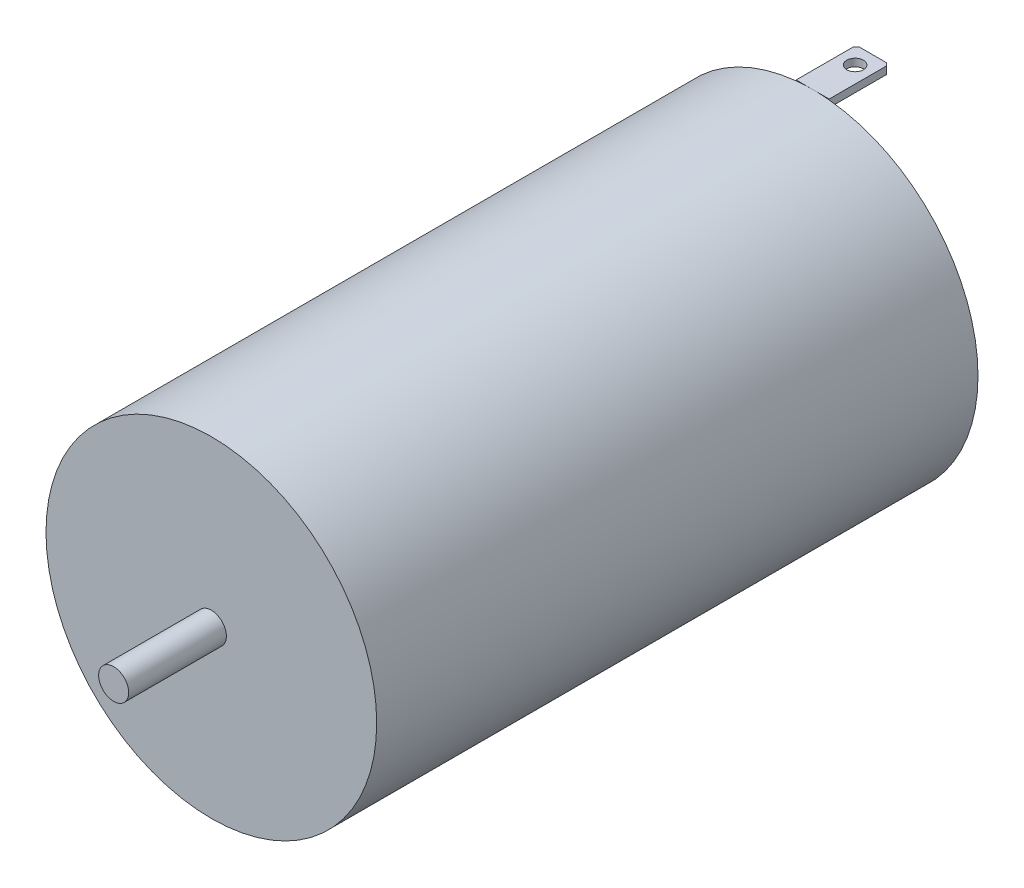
ISO-10303-21;
HEADER;
FILE_DESCRIPTION(('STEP AP214'),'2;1');
FILE_NAME('part.step','',(''),(''),'','','');
FILE_SCHEMA(('AUTOMOTIVE_DESIGN { 1 0 10303 214 1 1 1 1 }'));
ENDSEC;
DATA;
#1=APPLICATION_CONTEXT('core data for automotive mechanical design processes');
#2=APPLICATION_PROTOCOL_DEFINITION('international standard','automotive_design',2000,#1);
#3=PRODUCT_CONTEXT('',#1,'mechanical');
#4=PRODUCT('Part','Part','',(#3));
#5=PRODUCT_RELATED_PRODUCT_CATEGORY('part','',(#4));
#6=PRODUCT_DEFINITION_FORMATION('','',#4);
#7=PRODUCT_DEFINITION_CONTEXT('part definition',#1,'design');
#8=PRODUCT_DEFINITION('design','',#6,#7);
#9=PRODUCT_DEFINITION_SHAPE('','',#8);
#10=(LENGTH_UNIT() NAMED_UNIT(*) SI_UNIT(.MILLI.,.METRE.));
#11=(NAMED_UNIT(*) PLANE_ANGLE_UNIT() SI_UNIT($,.RADIAN.));
#12=(NAMED_UNIT(*) SI_UNIT($,.STERADIAN.) SOLID_ANGLE_UNIT());
#13=UNCERTAINTY_MEASURE_WITH_UNIT(LENGTH_MEASURE(1.E-05),#10,'distance_accuracy_value','');
#14=(GEOMETRIC_REPRESENTATION_CONTEXT(3) GLOBAL_UNCERTAINTY_ASSIGNED_CONTEXT((#13)) GLOBAL_UNIT_ASSIGNED_CONTEXT((#10,
#11,#12)) REPRESENTATION_CONTEXT('',''));
#15=CARTESIAN_POINT('',(0.,0.,0.));
#16=DIRECTION('',(0.,0.,1.));
#17=DIRECTION('',(1.,0.,0.));
#18=AXIS2_PLACEMENT_3D('',#15,#16,#17);
#19=CARTESIAN_POINT('',(0.,0.,0.));
#20=DIRECTION('',(0.,0.,1.));
#21=DIRECTION('',(1.,0.,0.));
#22=AXIS2_PLACEMENT_3D('',#19,#20,#21);
#23=PLANE('',#22);
#24=DIRECTION('',(0.,0.999999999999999,0.));
#25=VECTOR('',#24,1.);
#26=CARTESIAN_POINT('',(1.1,10.5,0.));
#27=LINE('',#26,#25);
#28=CARTESIAN_POINT('',(1.1,10.5,0.));
#29=VERTEX_POINT('',#28);
#30=CARTESIAN_POINT('',(1.1,10.9448618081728,0.));
#31=VERTEX_POINT('',#30);
#32=EDGE_CURVE('E190',#29,#31,#27,.T.);
#33=ORIENTED_EDGE('',*,*,#32,.T.);
#34=CARTESIAN_POINT('',(0.,0.,0.));
#35=DIRECTION('',(0.,0.,1.));
#36=DIRECTION('',(1.,0.,0.));
#37=AXIS2_PLACEMENT_3D('',#34,#35,#36);
#38=CIRCLE('',#37,11.);
#39=CARTESIAN_POINT('',(1.1,-10.9448618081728,0.));
#40=VERTEX_POINT('',#39);
#41=EDGE_CURVE('E537',#40,#31,#38,.T.);
#42=ORIENTED_EDGE('',*,*,#41,.F.);
#43=DIRECTION('',(0.,-0.999999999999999,0.));
#44=VECTOR('',#43,1.);
#45=CARTESIAN_POINT('',(1.09999999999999,-10.5,0.));
#46=LINE('',#45,#44);
#47=CARTESIAN_POINT('',(1.09999999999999,-10.5,0.));
#48=VERTEX_POINT('',#47);
#49=EDGE_CURVE('E229',#48,#40,#46,.T.);
#50=ORIENTED_EDGE('',*,*,#49,.F.);
#51=DIRECTION('',(-1.,0.,0.));
#52=VECTOR('',#51,1.);
#53=CARTESIAN_POINT('',(1.09999999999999,-10.5,0.));
#54=LINE('',#53,#52);
#55=CARTESIAN_POINT('',(-1.09999999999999,-10.5,0.));
#56=VERTEX_POINT('',#55);
#57=EDGE_CURVE('E214',#48,#56,#54,.T.);
#58=ORIENTED_EDGE('',*,*,#57,.T.);
#59=DIRECTION('',(0.,-0.999999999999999,0.));
#60=VECTOR('',#59,1.);
#61=CARTESIAN_POINT('',(-1.09999999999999,-10.5,0.));
#62=LINE('',#61,#60);
#63=CARTESIAN_POINT('',(-1.1,-10.9448618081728,0.));
#64=VERTEX_POINT('',#63);
#65=EDGE_CURVE('E224',#56,#64,#62,.T.);
#66=ORIENTED_EDGE('',*,*,#65,.T.);
#67=CARTESIAN_POINT('',(-1.10000000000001,10.9448618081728,0.));
#68=VERTEX_POINT('',#67);
#69=EDGE_CURVE('E237',#68,#64,#38,.T.);
#70=ORIENTED_EDGE('',*,*,#69,.F.);
#71=DIRECTION('',(0.,0.999999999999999,0.));
#72=VECTOR('',#71,1.);
#73=CARTESIAN_POINT('',(-1.1,10.5,0.));
#74=LINE('',#73,#72);
#75=CARTESIAN_POINT('',(-1.1,10.5,0.));
#76=VERTEX_POINT('',#75);
#77=EDGE_CURVE('E156',#76,#68,#74,.T.);
#78=ORIENTED_EDGE('',*,*,#77,.F.);
#79=DIRECTION('',(-1.,0.,0.));
#80=VECTOR('',#79,1.);
#81=CARTESIAN_POINT('',(1.1,10.5,0.));
#82=LINE('',#81,#80);
#83=EDGE_CURVE('E160',#29,#76,#82,.T.);
#84=ORIENTED_EDGE('',*,*,#83,.F.);
#85=EDGE_LOOP('',(#33,#42,#50,#58,#66,#70,#78,#84));
#86=FACE_BOUND('',#85,.T.);
#87=ADVANCED_FACE('F42',(#86),#23,.F.);
#88=CARTESIAN_POINT('',(0.,0.,40.));
#89=DIRECTION('',(0.,0.,1.));
#90=DIRECTION('',(1.,0.,0.));
#91=AXIS2_PLACEMENT_3D('',#88,#89,#90);
#92=PLANE('',#91);
#93=CARTESIAN_POINT('',(0.,0.,40.));
#94=DIRECTION('',(0.,0.,1.));
#95=DIRECTION('',(1.,0.,0.));
#96=AXIS2_PLACEMENT_3D('',#93,#94,#95);
#97=CIRCLE('',#96,11.);
#98=CARTESIAN_POINT('',(11.,0.,40.));
#99=VERTEX_POINT('',#98);
#100=EDGE_CURVE('E241',#99,#99,#97,.T.);
#101=ORIENTED_EDGE('',*,*,#100,.T.);
#102=EDGE_LOOP('',(#101));
#103=FACE_BOUND('',#102,.T.);
#104=CARTESIAN_POINT('',(0.,0.,40.));
#105=DIRECTION('',(0.,0.,1.));
#106=DIRECTION('',(1.,0.,0.));
#107=AXIS2_PLACEMENT_3D('',#104,#105,#106);
#108=CIRCLE('',#107,1.);
#109=CARTESIAN_POINT('',(1.00000000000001,0.,40.));
#110=VERTEX_POINT('',#109);
#111=EDGE_CURVE('E227',#110,#110,#108,.T.);
#112=ORIENTED_EDGE('',*,*,#111,.F.);
#113=EDGE_LOOP('',(#112));
#114=FACE_BOUND('',#113,.T.);
#115=ADVANCED_FACE('F295',(#103,#114),#92,.T.);
#116=CARTESIAN_POINT('',(0.,0.,40.));
#117=DIRECTION('',(0.,0.,-1.));
#118=DIRECTION('',(-1.,0.,0.));
#119=AXIS2_PLACEMENT_3D('',#116,#117,#118);
#120=CYLINDRICAL_SURFACE('',#119,11.);
#121=ORIENTED_EDGE('',*,*,#100,.F.);
#122=EDGE_LOOP('',(#121));
#123=FACE_BOUND('',#122,.T.);
#124=CARTESIAN_POINT('',(0.,-11.,0.));
#125=VERTEX_POINT('',#124);
#126=EDGE_CURVE('E238',#64,#125,#38,.T.);
#127=ORIENTED_EDGE('',*,*,#126,.T.);
#128=EDGE_CURVE('E242',#125,#40,#38,.T.);
#129=ORIENTED_EDGE('',*,*,#128,.T.);
#130=ORIENTED_EDGE('',*,*,#41,.T.);
#131=CARTESIAN_POINT('',(0.,11.,0.));
#132=VERTEX_POINT('',#131);
#133=EDGE_CURVE('E538',#31,#132,#38,.T.);
#134=ORIENTED_EDGE('',*,*,#133,.T.);
#135=EDGE_CURVE('E166',#132,#68,#38,.T.);
#136=ORIENTED_EDGE('',*,*,#135,.T.);
#137=ORIENTED_EDGE('',*,*,#69,.T.);
#138=EDGE_LOOP('',(#127,#129,#130,#134,#136,#137));
#139=FACE_BOUND('',#138,.T.);
#140=ADVANCED_FACE('F44',(#123,#139),#120,.T.);
#141=CARTESIAN_POINT('',(0.,0.,46.5));
#142=DIRECTION('',(0.,0.,-1.));
#143=DIRECTION('',(-1.,0.,0.));
#144=AXIS2_PLACEMENT_3D('',#141,#142,#143);
#145=CYLINDRICAL_SURFACE('',#144,1.);
#146=CARTESIAN_POINT('',(0.,0.,46.5));
#147=DIRECTION('',(0.,0.,1.));
#148=DIRECTION('',(1.,0.,0.));
#149=AXIS2_PLACEMENT_3D('',#146,#147,#148);
#150=CIRCLE('',#149,1.);
#151=CARTESIAN_POINT('',(0.999999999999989,0.,46.5));
#152=VERTEX_POINT('',#151);
#153=EDGE_CURVE('E234',#152,#152,#150,.T.);
#154=ORIENTED_EDGE('',*,*,#153,.F.);
#155=EDGE_LOOP('',(#154));
#156=FACE_BOUND('',#155,.T.);
#157=ORIENTED_EDGE('',*,*,#111,.T.);
#158=EDGE_LOOP('',(#157));
#159=FACE_BOUND('',#158,.T.);
#160=ADVANCED_FACE('F303',(#156,#159),#145,.T.);
#161=CARTESIAN_POINT('',(0.,0.,46.5));
#162=DIRECTION('',(0.,0.,1.));
#163=DIRECTION('',(1.,0.,0.));
#164=AXIS2_PLACEMENT_3D('',#161,#162,#163);
#165=PLANE('',#164);
#166=ORIENTED_EDGE('',*,*,#153,.T.);
#167=EDGE_LOOP('',(#166));
#168=FACE_BOUND('',#167,.T.);
#169=ADVANCED_FACE('F306',(#168),#165,.T.);
#170=CARTESIAN_POINT('',(1.09999999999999,-10.5,0.));
#171=DIRECTION('',(0.,0.,1.));
#172=DIRECTION('',(1.,0.,0.));
#173=AXIS2_PLACEMENT_3D('',#170,#171,#172);
#174=PLANE('',#173);
#175=ORIENTED_EDGE('',*,*,#126,.F.);
#176=CARTESIAN_POINT('',(-1.10000000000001,-11.,0.));
#177=VERTEX_POINT('',#176);
#178=EDGE_CURVE('E228',#64,#177,#62,.T.);
#179=ORIENTED_EDGE('',*,*,#178,.T.);
#180=DIRECTION('',(-1.,0.,0.));
#181=VECTOR('',#180,1.);
#182=CARTESIAN_POINT('',(1.10000000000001,-10.9999999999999,0.));
#183=LINE('',#182,#181);
#184=EDGE_CURVE('E202',#125,#177,#183,.T.);
#185=ORIENTED_EDGE('',*,*,#184,.F.);
#186=EDGE_LOOP('',(#175,#179,#185));
#187=FACE_BOUND('',#186,.T.);
#188=ADVANCED_FACE('F310',(#187),#174,.T.);
#189=ORIENTED_EDGE('',*,*,#128,.F.);
#190=CARTESIAN_POINT('',(1.10000000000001,-10.9999999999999,0.));
#191=VERTEX_POINT('',#190);
#192=EDGE_CURVE('E203',#191,#125,#183,.T.);
#193=ORIENTED_EDGE('',*,*,#192,.F.);
#194=EDGE_CURVE('E223',#40,#191,#46,.T.);
#195=ORIENTED_EDGE('',*,*,#194,.F.);
#196=EDGE_LOOP('',(#189,#193,#195));
#197=FACE_BOUND('',#196,.T.);
#198=ADVANCED_FACE('F316',(#197),#174,.T.);
#199=CARTESIAN_POINT('',(1.09999999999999,-10.5,0.));
#200=DIRECTION('',(1.,0.,0.));
#201=DIRECTION('',(0.,0.999999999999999,0.));
#202=AXIS2_PLACEMENT_3D('',#199,#200,#201);
#203=PLANE('',#202);
#204=DIRECTION('',(0.,0.,1.));
#205=VECTOR('',#204,1.);
#206=CARTESIAN_POINT('',(1.10000000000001,-10.9999999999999,0.));
#207=LINE('',#206,#205);
#208=CARTESIAN_POINT('',(1.10000000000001,-11.,-3.79999999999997));
#209=VERTEX_POINT('',#208);
#210=EDGE_CURVE('E200',#209,#191,#207,.T.);
#211=ORIENTED_EDGE('',*,*,#210,.F.);
#212=DIRECTION('',(0.,0.999999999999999,0.));
#213=VECTOR('',#212,1.);
#214=CARTESIAN_POINT('',(1.09999999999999,-10.5,-3.79999999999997));
#215=LINE('',#214,#213);
#216=CARTESIAN_POINT('',(1.09999999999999,-10.5,-3.79999999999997));
#217=VERTEX_POINT('',#216);
#218=EDGE_CURVE('E261',#209,#217,#215,.T.);
#219=ORIENTED_EDGE('',*,*,#218,.T.);
#220=DIRECTION('',(0.,0.,1.));
#221=VECTOR('',#220,1.);
#222=CARTESIAN_POINT('',(1.09999999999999,-10.5,0.));
#223=LINE('',#222,#221);
#224=EDGE_CURVE('E212',#217,#48,#223,.T.);
#225=ORIENTED_EDGE('',*,*,#224,.T.);
#226=ORIENTED_EDGE('',*,*,#49,.T.);
#227=ORIENTED_EDGE('',*,*,#194,.T.);
#228=EDGE_LOOP('',(#211,#219,#225,#226,#227));
#229=FACE_BOUND('',#228,.T.);
#230=ADVANCED_FACE('F312',(#229),#203,.T.);
#231=CARTESIAN_POINT('',(1.10000000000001,-10.5,-3.99999999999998));
#232=DIRECTION('',(0.,0.,-1.));
#233=DIRECTION('',(-1.,0.,0.));
#234=AXIS2_PLACEMENT_3D('',#231,#232,#233);
#235=PLANE('',#234);
#236=DIRECTION('',(1.,0.,0.));
#237=VECTOR('',#236,1.);
#238=CARTESIAN_POINT('',(1.09999999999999,-11.,-4.));
#239=LINE('',#238,#237);
#240=CARTESIAN_POINT('',(-0.900000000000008,-11.,-4.));
#241=VERTEX_POINT('',#240);
#242=CARTESIAN_POINT('',(0.899999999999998,-11.,-3.99999999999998));
#243=VERTEX_POINT('',#242);
#244=EDGE_CURVE('E209',#241,#243,#239,.T.);
#245=ORIENTED_EDGE('',*,*,#244,.F.);
#246=DIRECTION('',(0.,0.999999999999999,0.));
#247=VECTOR('',#246,1.);
#248=CARTESIAN_POINT('',(-0.900000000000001,-10.5,-3.99999999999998));
#249=LINE('',#248,#247);
#250=CARTESIAN_POINT('',(-0.900000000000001,-10.5,-3.99999999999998));
#251=VERTEX_POINT('',#250);
#252=EDGE_CURVE('E255',#241,#251,#249,.T.);
#253=ORIENTED_EDGE('',*,*,#252,.T.);
#254=DIRECTION('',(1.,0.,0.));
#255=VECTOR('',#254,1.);
#256=CARTESIAN_POINT('',(1.10000000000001,-10.5,-3.99999999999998));
#257=LINE('',#256,#255);
#258=CARTESIAN_POINT('',(0.899999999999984,-10.5,-3.99999999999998));
#259=VERTEX_POINT('',#258);
#260=EDGE_CURVE('E220',#251,#259,#257,.T.);
#261=ORIENTED_EDGE('',*,*,#260,.T.);
#262=DIRECTION('',(0.,-0.999999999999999,0.));
#263=VECTOR('',#262,1.);
#264=CARTESIAN_POINT('',(0.899999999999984,-10.5,-3.99999999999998));
#265=LINE('',#264,#263);
#266=EDGE_CURVE('E252',#259,#243,#265,.T.);
#267=ORIENTED_EDGE('',*,*,#266,.T.);
#268=EDGE_LOOP('',(#245,#253,#261,#267));
#269=FACE_BOUND('',#268,.T.);
#270=ADVANCED_FACE('F315',(#269),#235,.T.);
#271=CARTESIAN_POINT('',(-1.09999999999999,-10.5,0.));
#272=DIRECTION('',(-1.,0.,0.));
#273=DIRECTION('',(0.,-0.999999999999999,0.));
#274=AXIS2_PLACEMENT_3D('',#271,#272,#273);
#275=PLANE('',#274);
#276=DIRECTION('',(0.,0.,-1.));
#277=VECTOR('',#276,1.);
#278=CARTESIAN_POINT('',(-1.09999999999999,-10.5,0.));
#279=LINE('',#278,#277);
#280=CARTESIAN_POINT('',(-1.09999999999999,-10.5,-3.79999999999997));
#281=VERTEX_POINT('',#280);
#282=EDGE_CURVE('E217',#56,#281,#279,.T.);
#283=ORIENTED_EDGE('',*,*,#282,.T.);
#284=DIRECTION('',(0.,-0.999999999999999,0.));
#285=VECTOR('',#284,1.);
#286=CARTESIAN_POINT('',(-1.09999999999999,-10.5,-3.79999999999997));
#287=LINE('',#286,#285);
#288=CARTESIAN_POINT('',(-1.1,-11.,-3.79999999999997));
#289=VERTEX_POINT('',#288);
#290=EDGE_CURVE('E245',#281,#289,#287,.T.);
#291=ORIENTED_EDGE('',*,*,#290,.T.);
#292=DIRECTION('',(0.,0.,-1.));
#293=VECTOR('',#292,1.);
#294=CARTESIAN_POINT('',(-1.10000000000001,-11.,0.));
#295=LINE('',#294,#293);
#296=EDGE_CURVE('E206',#177,#289,#295,.T.);
#297=ORIENTED_EDGE('',*,*,#296,.F.);
#298=ORIENTED_EDGE('',*,*,#178,.F.);
#299=ORIENTED_EDGE('',*,*,#65,.F.);
#300=EDGE_LOOP('',(#283,#291,#297,#298,#299));
#301=FACE_BOUND('',#300,.T.);
#302=ADVANCED_FACE('F321',(#301),#275,.T.);
#303=CARTESIAN_POINT('',(1.10000000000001,-10.5,-3.99999999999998));
#304=DIRECTION('',(0.,0.999999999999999,0.));
#305=DIRECTION('',(0.,0.,1.));
#306=AXIS2_PLACEMENT_3D('',#303,#304,#305);
#307=PLANE('',#306);
#308=CARTESIAN_POINT('',(0.,-10.5,-2.8244894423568));
#309=DIRECTION('',(0.,-0.999999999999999,0.));
#310=DIRECTION('',(1.,0.,0.));
#311=AXIS2_PLACEMENT_3D('',#308,#309,#310);
#312=CIRCLE('',#311,0.554374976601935);
#313=CARTESIAN_POINT('',(0.554374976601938,-10.5,-2.8244894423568));
#314=VERTEX_POINT('',#313);
#315=EDGE_CURVE('E197',#314,#314,#312,.T.);
#316=ORIENTED_EDGE('',*,*,#315,.T.);
#317=EDGE_LOOP('',(#316));
#318=FACE_BOUND('',#317,.T.);
#319=ORIENTED_EDGE('',*,*,#260,.F.);
#320=DIRECTION('',(0.70710678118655,0.,-0.707106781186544));
#321=VECTOR('',#320,1.);
#322=CARTESIAN_POINT('',(0.100000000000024,-10.5,-4.99999999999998));
#323=LINE('',#322,#321);
#324=EDGE_CURVE('E259',#251,#281,#323,.F.);
#325=ORIENTED_EDGE('',*,*,#324,.T.);
#326=ORIENTED_EDGE('',*,*,#282,.F.);
#327=ORIENTED_EDGE('',*,*,#57,.F.);
#328=ORIENTED_EDGE('',*,*,#224,.F.);
#329=DIRECTION('',(0.707106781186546,0.,0.707106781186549));
#330=VECTOR('',#329,1.);
#331=CARTESIAN_POINT('',(0.999999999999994,-10.5,-3.90000000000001));
#332=LINE('',#331,#330);
#333=EDGE_CURVE('E257',#217,#259,#332,.F.);
#334=ORIENTED_EDGE('',*,*,#333,.T.);
#335=EDGE_LOOP('',(#319,#325,#326,#327,#328,#334));
#336=FACE_BOUND('',#335,.T.);
#337=ADVANCED_FACE('F324',(#318,#336),#307,.T.);
#338=CARTESIAN_POINT('',(1.09999999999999,-11.,-4.));
#339=DIRECTION('',(0.,0.999999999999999,0.));
#340=DIRECTION('',(0.,0.,1.));
#341=AXIS2_PLACEMENT_3D('',#338,#339,#340);
#342=PLANE('',#341);
#343=CARTESIAN_POINT('',(0.,-11.,-2.8244894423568));
#344=DIRECTION('',(0.,-0.999999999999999,0.));
#345=DIRECTION('',(1.,0.,0.));
#346=AXIS2_PLACEMENT_3D('',#343,#344,#345);
#347=CIRCLE('',#346,0.554374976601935);
#348=CARTESIAN_POINT('',(0.554374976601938,-11.,-2.8244894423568));
#349=VERTEX_POINT('',#348);
#350=EDGE_CURVE('E192',#349,#349,#347,.T.);
#351=ORIENTED_EDGE('',*,*,#350,.F.);
#352=EDGE_LOOP('',(#351));
#353=FACE_BOUND('',#352,.T.);
#354=ORIENTED_EDGE('',*,*,#296,.T.);
#355=DIRECTION('',(-0.70710678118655,0.,0.707106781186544));
#356=VECTOR('',#355,1.);
#357=CARTESIAN_POINT('',(-1.1,-11.,-3.79999999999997));
#358=LINE('',#357,#356);
#359=EDGE_CURVE('E250',#289,#241,#358,.F.);
#360=ORIENTED_EDGE('',*,*,#359,.T.);
#361=ORIENTED_EDGE('',*,*,#244,.T.);
#362=DIRECTION('',(-0.707106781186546,0.,-0.707106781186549));
#363=VECTOR('',#362,1.);
#364=CARTESIAN_POINT('',(0.899999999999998,-11.,-3.99999999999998));
#365=LINE('',#364,#363);
#366=EDGE_CURVE('E248',#243,#209,#365,.F.);
#367=ORIENTED_EDGE('',*,*,#366,.T.);
#368=ORIENTED_EDGE('',*,*,#210,.T.);
#369=ORIENTED_EDGE('',*,*,#192,.T.);
#370=ORIENTED_EDGE('',*,*,#184,.T.);
#371=EDGE_LOOP('',(#354,#360,#361,#367,#368,#369,#370));
#372=FACE_BOUND('',#371,.T.);
#373=ADVANCED_FACE('F331',(#353,#372),#342,.F.);
#374=CARTESIAN_POINT('',(0.,-10.5,-2.8244894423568));
#375=DIRECTION('',(0.,-0.999999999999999,0.));
#376=DIRECTION('',(1.,0.,0.));
#377=AXIS2_PLACEMENT_3D('',#374,#375,#376);
#378=CYLINDRICAL_SURFACE('',#377,0.554374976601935);
#379=CARTESIAN_POINT('',(0.554374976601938,-10.5,-2.8244894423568));
#380=CARTESIAN_POINT('',(0.554374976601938,-10.5052083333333,-2.8244894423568));
#381=CARTESIAN_POINT('',(0.554374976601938,-10.5104166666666,-2.8244894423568));
#382=CARTESIAN_POINT('',(0.554374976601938,-10.5208333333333,-2.8244894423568));
#383=CARTESIAN_POINT('',(0.554374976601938,-10.5260416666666,-2.8244894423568));
#384=CARTESIAN_POINT('',(0.554374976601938,-10.5364583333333,-2.8244894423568));
#385=CARTESIAN_POINT('',(0.554374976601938,-10.5416666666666,-2.8244894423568));
#386=CARTESIAN_POINT('',(0.554374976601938,-10.5520833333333,-2.8244894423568));
#387=CARTESIAN_POINT('',(0.554374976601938,-10.5572916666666,-2.8244894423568));
#388=CARTESIAN_POINT('',(0.554374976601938,-10.5677083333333,-2.8244894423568));
#389=CARTESIAN_POINT('',(0.554374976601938,-10.5729166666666,-2.8244894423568));
#390=CARTESIAN_POINT('',(0.554374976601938,-10.5833333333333,-2.8244894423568));
#391=CARTESIAN_POINT('',(0.554374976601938,-10.5885416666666,-2.8244894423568));
#392=CARTESIAN_POINT('',(0.554374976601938,-10.5989583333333,-2.8244894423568));
#393=CARTESIAN_POINT('',(0.554374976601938,-10.6041666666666,-2.8244894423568));
#394=CARTESIAN_POINT('',(0.554374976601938,-10.6145833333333,-2.8244894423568));
#395=CARTESIAN_POINT('',(0.554374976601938,-10.6197916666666,-2.8244894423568));
#396=CARTESIAN_POINT('',(0.554374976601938,-10.6302083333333,-2.8244894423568));
#397=CARTESIAN_POINT('',(0.554374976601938,-10.6354166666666,-2.8244894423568));
#398=CARTESIAN_POINT('',(0.554374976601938,-10.6458333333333,-2.8244894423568));
#399=CARTESIAN_POINT('',(0.554374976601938,-10.6510416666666,-2.8244894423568));
#400=CARTESIAN_POINT('',(0.554374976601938,-10.6614583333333,-2.8244894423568));
#401=CARTESIAN_POINT('',(0.554374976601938,-10.6666666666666,-2.8244894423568));
#402=CARTESIAN_POINT('',(0.554374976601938,-10.6770833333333,-2.8244894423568));
#403=CARTESIAN_POINT('',(0.554374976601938,-10.6822916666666,-2.8244894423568));
#404=CARTESIAN_POINT('',(0.554374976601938,-10.6927083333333,-2.8244894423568));
#405=CARTESIAN_POINT('',(0.554374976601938,-10.6979166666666,-2.8244894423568));
#406=CARTESIAN_POINT('',(0.554374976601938,-10.7083333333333,-2.8244894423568));
#407=CARTESIAN_POINT('',(0.554374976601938,-10.7135416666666,-2.8244894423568));
#408=CARTESIAN_POINT('',(0.554374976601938,-10.7239583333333,-2.8244894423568));
#409=CARTESIAN_POINT('',(0.554374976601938,-10.7291666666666,-2.8244894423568));
#410=CARTESIAN_POINT('',(0.554374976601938,-10.7395833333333,-2.8244894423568));
#411=CARTESIAN_POINT('',(0.554374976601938,-10.7447916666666,-2.8244894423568));
#412=CARTESIAN_POINT('',(0.554374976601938,-10.7552083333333,-2.8244894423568));
#413=CARTESIAN_POINT('',(0.554374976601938,-10.7604166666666,-2.8244894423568));
#414=CARTESIAN_POINT('',(0.554374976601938,-10.7708333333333,-2.8244894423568));
#415=CARTESIAN_POINT('',(0.554374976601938,-10.7760416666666,-2.8244894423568));
#416=CARTESIAN_POINT('',(0.554374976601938,-10.7864583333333,-2.8244894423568));
#417=CARTESIAN_POINT('',(0.554374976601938,-10.7916666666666,-2.8244894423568));
#418=CARTESIAN_POINT('',(0.554374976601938,-10.8020833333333,-2.8244894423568));
#419=CARTESIAN_POINT('',(0.554374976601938,-10.8072916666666,-2.8244894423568));
#420=CARTESIAN_POINT('',(0.554374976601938,-10.8177083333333,-2.8244894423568));
#421=CARTESIAN_POINT('',(0.554374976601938,-10.8229166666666,-2.8244894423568));
#422=CARTESIAN_POINT('',(0.554374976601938,-10.8333333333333,-2.8244894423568));
#423=CARTESIAN_POINT('',(0.554374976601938,-10.8385416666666,-2.8244894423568));
#424=CARTESIAN_POINT('',(0.554374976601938,-10.8489583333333,-2.8244894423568));
#425=CARTESIAN_POINT('',(0.554374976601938,-10.8541666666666,-2.8244894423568));
#426=CARTESIAN_POINT('',(0.554374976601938,-10.8645833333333,-2.8244894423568));
#427=CARTESIAN_POINT('',(0.554374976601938,-10.8697916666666,-2.8244894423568));
#428=CARTESIAN_POINT('',(0.554374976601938,-10.8802083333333,-2.8244894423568));
#429=CARTESIAN_POINT('',(0.554374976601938,-10.8854166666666,-2.8244894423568));
#430=CARTESIAN_POINT('',(0.554374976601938,-10.8958333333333,-2.8244894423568));
#431=CARTESIAN_POINT('',(0.554374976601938,-10.9010416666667,-2.8244894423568));
#432=CARTESIAN_POINT('',(0.554374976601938,-10.9114583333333,-2.8244894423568));
#433=CARTESIAN_POINT('',(0.554374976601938,-10.9166666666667,-2.8244894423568));
#434=CARTESIAN_POINT('',(0.554374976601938,-10.9270833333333,-2.8244894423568));
#435=CARTESIAN_POINT('',(0.554374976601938,-10.9322916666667,-2.8244894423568));
#436=CARTESIAN_POINT('',(0.554374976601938,-10.9427083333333,-2.8244894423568));
#437=CARTESIAN_POINT('',(0.554374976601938,-10.9479166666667,-2.8244894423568));
#438=CARTESIAN_POINT('',(0.554374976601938,-10.9583333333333,-2.8244894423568));
#439=CARTESIAN_POINT('',(0.554374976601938,-10.9635416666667,-2.8244894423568));
#440=CARTESIAN_POINT('',(0.554374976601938,-10.9739583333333,-2.8244894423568));
#441=CARTESIAN_POINT('',(0.554374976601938,-10.9791666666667,-2.8244894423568));
#442=CARTESIAN_POINT('',(0.554374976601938,-10.9895833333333,-2.8244894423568));
#443=CARTESIAN_POINT('',(0.554374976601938,-10.9947916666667,-2.8244894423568));
#444=CARTESIAN_POINT('',(0.554374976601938,-11.,-2.8244894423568));
#445=B_SPLINE_CURVE_WITH_KNOTS('',3,(#379,#380,#381,#382,#383,#384,#385,#386,#387,#388,#389,
#390,#391,#392,#393,#394,#395,#396,#397,#398,#399,#400,#401,#402,#403,#404,#405,#406,#407,#408,
#409,#410,#411,#412,#413,#414,#415,#416,#417,#418,#419,#420,#421,#422,#423,#424,#425,#426,#427,
#428,#429,#430,#431,#432,#433,#434,#435,#436,#437,#438,#439,#440,#441,#442,#443,#444),
.UNSPECIFIED.,.F.,.F.,(4,2,2,2,2,2,2,2,2,2,2,2,2,2,2,2,2,2,2,2,2,2,2,2,2,2,2,2,2,2,2,2,4),(0.,
0.0156250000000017,0.0312500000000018,0.0468750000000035,0.0625000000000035,0.0781250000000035,
0.0937500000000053,0.109375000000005,0.125000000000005,0.140625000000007,0.156250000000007,
0.171875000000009,0.187500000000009,0.203125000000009,0.218750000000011,0.234375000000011,
0.250000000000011,0.265625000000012,0.281250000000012,0.296875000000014,0.312500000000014,
0.328125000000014,0.343750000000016,0.359375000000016,0.375000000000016,0.390625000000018,
0.406250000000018,0.421875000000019,0.437500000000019,0.453125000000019,0.468750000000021,
0.484375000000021,0.500000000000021),.UNSPECIFIED.);
#446=EDGE_CURVE('BSEAM335',#314,#349,#445,.T.);
#447=ORIENTED_EDGE('',*,*,#315,.F.);
#448=ORIENTED_EDGE('',*,*,#350,.T.);
#449=ORIENTED_EDGE('',*,*,#446,.T.);
#450=ORIENTED_EDGE('',*,*,#446,.F.);
#451=EDGE_LOOP('',(#447,#449,#448,#450));
#452=FACE_BOUND('',#451,.T.);
#453=ADVANCED_FACE('F335',(#452),#378,.F.);
#454=CARTESIAN_POINT('',(-1.09999999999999,-10.5,-3.79999999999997));
#455=DIRECTION('',(0.707106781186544,0.,0.707106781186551));
#456=DIRECTION('',(0.70710678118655,0.,-0.707106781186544));
#457=AXIS2_PLACEMENT_3D('',#454,#455,#456);
#458=PLANE('',#457);
#459=ORIENTED_EDGE('',*,*,#324,.F.);
#460=ORIENTED_EDGE('',*,*,#252,.F.);
#461=ORIENTED_EDGE('',*,*,#359,.F.);
#462=ORIENTED_EDGE('',*,*,#290,.F.);
#463=EDGE_LOOP('',(#459,#460,#461,#462));
#464=FACE_BOUND('',#463,.T.);
#465=ADVANCED_FACE('F339',(#464),#458,.F.);
#466=CARTESIAN_POINT('',(0.899999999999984,-10.5,-3.99999999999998));
#467=DIRECTION('',(-0.707106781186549,0.,0.707106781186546));
#468=DIRECTION('',(0.707106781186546,0.,0.707106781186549));
#469=AXIS2_PLACEMENT_3D('',#466,#467,#468);
#470=PLANE('',#469);
#471=ORIENTED_EDGE('',*,*,#333,.F.);
#472=ORIENTED_EDGE('',*,*,#218,.F.);
#473=ORIENTED_EDGE('',*,*,#366,.F.);
#474=ORIENTED_EDGE('',*,*,#266,.F.);
#475=EDGE_LOOP('',(#471,#472,#473,#474));
#476=FACE_BOUND('',#475,.T.);
#477=ADVANCED_FACE('F343',(#476),#470,.F.);
#478=CARTESIAN_POINT('',(1.1,10.5,0.));
#479=DIRECTION('',(0.,0.,-1.));
#480=DIRECTION('',(-1.,0.,0.));
#481=AXIS2_PLACEMENT_3D('',#478,#479,#480);
#482=PLANE('',#481);
#483=CARTESIAN_POINT('',(-1.1,11.,0.));
#484=VERTEX_POINT('',#483);
#485=EDGE_CURVE('E150',#68,#484,#74,.T.);
#486=ORIENTED_EDGE('',*,*,#485,.F.);
#487=ORIENTED_EDGE('',*,*,#135,.F.);
#488=DIRECTION('',(-1.,0.,0.));
#489=VECTOR('',#488,1.);
#490=CARTESIAN_POINT('',(1.09999999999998,11.,0.));
#491=LINE('',#490,#489);
#492=EDGE_CURVE('E163',#132,#484,#491,.T.);
#493=ORIENTED_EDGE('',*,*,#492,.T.);
#494=EDGE_LOOP('',(#486,#487,#493));
#495=FACE_BOUND('',#494,.T.);
#496=ADVANCED_FACE('F164',(#495),#482,.F.);
#497=CARTESIAN_POINT('',(1.09999999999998,11.,0.));
#498=VERTEX_POINT('',#497);
#499=EDGE_CURVE('E170',#498,#132,#491,.T.);
#500=ORIENTED_EDGE('',*,*,#499,.T.);
#501=ORIENTED_EDGE('',*,*,#133,.F.);
#502=EDGE_CURVE('E193',#31,#498,#27,.T.);
#503=ORIENTED_EDGE('',*,*,#502,.T.);
#504=EDGE_LOOP('',(#500,#501,#503));
#505=FACE_BOUND('',#504,.T.);
#506=ADVANCED_FACE('F358',(#505),#482,.F.);
#507=CARTESIAN_POINT('',(1.1,10.5,-3.99999999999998));
#508=DIRECTION('',(0.,-0.999999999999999,0.));
#509=DIRECTION('',(0.,0.,1.));
#510=AXIS2_PLACEMENT_3D('',#507,#508,#509);
#511=PLANE('',#510);
#512=DIRECTION('',(0.,0.,-1.));
#513=VECTOR('',#512,1.);
#514=CARTESIAN_POINT('',(-1.1,10.5,0.));
#515=LINE('',#514,#513);
#516=CARTESIAN_POINT('',(-1.10000000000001,10.5,-3.8));
#517=VERTEX_POINT('',#516);
#518=EDGE_CURVE('E187',#76,#517,#515,.T.);
#519=ORIENTED_EDGE('',*,*,#518,.T.);
#520=DIRECTION('',(-0.70710678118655,0.,0.707106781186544));
#521=VECTOR('',#520,1.);
#522=CARTESIAN_POINT('',(0.100000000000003,10.5,-5.));
#523=LINE('',#522,#521);
#524=CARTESIAN_POINT('',(-0.900000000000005,10.5,-3.99999999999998));
#525=VERTEX_POINT('',#524);
#526=EDGE_CURVE('E50',#517,#525,#523,.F.);
#527=ORIENTED_EDGE('',*,*,#526,.T.);
#528=DIRECTION('',(1.,0.,0.));
#529=VECTOR('',#528,1.);
#530=CARTESIAN_POINT('',(1.1,10.5,-3.99999999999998));
#531=LINE('',#530,#529);
#532=CARTESIAN_POINT('',(0.900000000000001,10.5,-4.));
#533=VERTEX_POINT('',#532);
#534=EDGE_CURVE('E185',#525,#533,#531,.T.);
#535=ORIENTED_EDGE('',*,*,#534,.T.);
#536=DIRECTION('',(-0.707106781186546,0.,-0.707106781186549));
#537=VECTOR('',#536,1.);
#538=CARTESIAN_POINT('',(1.00000000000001,10.5,-3.89999999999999));
#539=LINE('',#538,#537);
#540=CARTESIAN_POINT('',(1.09999999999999,10.5,-3.8));
#541=VERTEX_POINT('',#540);
#542=EDGE_CURVE('E57',#533,#541,#539,.F.);
#543=ORIENTED_EDGE('',*,*,#542,.T.);
#544=DIRECTION('',(0.,0.,1.));
#545=VECTOR('',#544,1.);
#546=CARTESIAN_POINT('',(1.1,10.5,0.));
#547=LINE('',#546,#545);
#548=EDGE_CURVE('E183',#541,#29,#547,.T.);
#549=ORIENTED_EDGE('',*,*,#548,.T.);
#550=ORIENTED_EDGE('',*,*,#83,.T.);
#551=EDGE_LOOP('',(#519,#527,#535,#543,#549,#550));
#552=FACE_BOUND('',#551,.T.);
#553=CARTESIAN_POINT('',(0.,10.5,-2.8244894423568));
#554=DIRECTION('',(0.,-0.999999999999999,0.));
#555=DIRECTION('',(1.,0.,0.));
#556=AXIS2_PLACEMENT_3D('',#553,#554,#555);
#557=CIRCLE('',#556,0.554374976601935);
#558=CARTESIAN_POINT('',(-0.554374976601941,10.5,-2.8244894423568));
#559=VERTEX_POINT('',#558);
#560=EDGE_CURVE('E546',#559,#559,#557,.T.);
#561=ORIENTED_EDGE('',*,*,#560,.F.);
#562=EDGE_LOOP('',(#561));
#563=FACE_BOUND('',#562,.T.);
#564=ADVANCED_FACE('F274',(#552,#563),#511,.T.);
#565=CARTESIAN_POINT('',(1.1,11.,-3.99999999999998));
#566=DIRECTION('',(0.,-0.999999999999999,0.));
#567=DIRECTION('',(0.,0.,1.));
#568=AXIS2_PLACEMENT_3D('',#565,#566,#567);
#569=PLANE('',#568);
#570=DIRECTION('',(1.,0.,0.));
#571=VECTOR('',#570,1.);
#572=CARTESIAN_POINT('',(1.1,11.,-3.99999999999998));
#573=LINE('',#572,#571);
#574=CARTESIAN_POINT('',(-0.900000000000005,11.,-4.));
#575=VERTEX_POINT('',#574);
#576=CARTESIAN_POINT('',(0.899999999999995,11.,-3.99999999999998));
#577=VERTEX_POINT('',#576);
#578=EDGE_CURVE('E176',#575,#577,#573,.T.);
#579=ORIENTED_EDGE('',*,*,#578,.F.);
#580=DIRECTION('',(0.70710678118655,0.,-0.707106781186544));
#581=VECTOR('',#580,1.);
#582=CARTESIAN_POINT('',(-0.900000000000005,11.,-4.));
#583=LINE('',#582,#581);
#584=CARTESIAN_POINT('',(-1.09999999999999,11.,-3.8));
#585=VERTEX_POINT('',#584);
#586=EDGE_CURVE('E175',#575,#585,#583,.F.);
#587=ORIENTED_EDGE('',*,*,#586,.T.);
#588=DIRECTION('',(0.,0.,-1.));
#589=VECTOR('',#588,1.);
#590=CARTESIAN_POINT('',(-1.1,11.,0.));
#591=LINE('',#590,#589);
#592=EDGE_CURVE('E154',#484,#585,#591,.T.);
#593=ORIENTED_EDGE('',*,*,#592,.F.);
#594=ORIENTED_EDGE('',*,*,#492,.F.);
#595=ORIENTED_EDGE('',*,*,#499,.F.);
#596=DIRECTION('',(0.,0.,1.));
#597=VECTOR('',#596,1.);
#598=CARTESIAN_POINT('',(1.09999999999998,11.,0.));
#599=LINE('',#598,#597);
#600=CARTESIAN_POINT('',(1.1,11.,-3.8));
#601=VERTEX_POINT('',#600);
#602=EDGE_CURVE('E179',#601,#498,#599,.T.);
#603=ORIENTED_EDGE('',*,*,#602,.F.);
#604=DIRECTION('',(0.707106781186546,0.,0.707106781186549));
#605=VECTOR('',#604,1.);
#606=CARTESIAN_POINT('',(1.1,11.,-3.8));
#607=LINE('',#606,#605);
#608=EDGE_CURVE('E268',#601,#577,#607,.F.);
#609=ORIENTED_EDGE('',*,*,#608,.T.);
#610=EDGE_LOOP('',(#579,#587,#593,#594,#595,#603,#609));
#611=FACE_BOUND('',#610,.T.);
#612=CARTESIAN_POINT('',(0.,11.,-2.82448944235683));
#613=DIRECTION('',(0.,-0.999999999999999,0.));
#614=DIRECTION('',(1.,0.,0.));
#615=AXIS2_PLACEMENT_3D('',#612,#613,#614);
#616=CIRCLE('',#615,0.554374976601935);
#617=CARTESIAN_POINT('',(-0.554374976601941,11.,-2.8244894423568));
#618=VERTEX_POINT('',#617);
#619=EDGE_CURVE('E548',#618,#618,#616,.T.);
#620=ORIENTED_EDGE('',*,*,#619,.T.);
#621=EDGE_LOOP('',(#620));
#622=FACE_BOUND('',#621,.T.);
#623=ADVANCED_FACE('F173',(#611,#622),#569,.F.);
#624=CARTESIAN_POINT('',(1.1,10.5,0.));
#625=DIRECTION('',(-1.,0.,0.));
#626=DIRECTION('',(0.,-0.999999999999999,0.));
#627=AXIS2_PLACEMENT_3D('',#624,#625,#626);
#628=PLANE('',#627);
#629=ORIENTED_EDGE('',*,*,#548,.F.);
#630=DIRECTION('',(0.,0.999999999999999,0.));
#631=VECTOR('',#630,1.);
#632=CARTESIAN_POINT('',(1.09999999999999,10.5,-3.8));
#633=LINE('',#632,#631);
#634=EDGE_CURVE('E11',#541,#601,#633,.T.);
#635=ORIENTED_EDGE('',*,*,#634,.T.);
#636=ORIENTED_EDGE('',*,*,#602,.T.);
#637=ORIENTED_EDGE('',*,*,#502,.F.);
#638=ORIENTED_EDGE('',*,*,#32,.F.);
#639=EDGE_LOOP('',(#629,#635,#636,#637,#638));
#640=FACE_BOUND('',#639,.T.);
#641=ADVANCED_FACE('F348',(#640),#628,.F.);
#642=CARTESIAN_POINT('',(-1.1,10.5,0.));
#643=DIRECTION('',(1.,0.,0.));
#644=DIRECTION('',(0.,0.999999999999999,0.));
#645=AXIS2_PLACEMENT_3D('',#642,#643,#644);
#646=PLANE('',#645);
#647=ORIENTED_EDGE('',*,*,#592,.T.);
#648=DIRECTION('',(0.,-0.999999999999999,0.));
#649=VECTOR('',#648,1.);
#650=CARTESIAN_POINT('',(-1.10000000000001,10.5,-3.8));
#651=LINE('',#650,#649);
#652=EDGE_CURVE('E65',#585,#517,#651,.T.);
#653=ORIENTED_EDGE('',*,*,#652,.T.);
#654=ORIENTED_EDGE('',*,*,#518,.F.);
#655=ORIENTED_EDGE('',*,*,#77,.T.);
#656=ORIENTED_EDGE('',*,*,#485,.T.);
#657=EDGE_LOOP('',(#647,#653,#654,#655,#656));
#658=FACE_BOUND('',#657,.T.);
#659=ADVANCED_FACE('F152',(#658),#646,.F.);
#660=CARTESIAN_POINT('',(1.1,10.5,-3.99999999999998));
#661=DIRECTION('',(0.,0.,1.));
#662=DIRECTION('',(1.,0.,0.));
#663=AXIS2_PLACEMENT_3D('',#660,#661,#662);
#664=PLANE('',#663);
#665=ORIENTED_EDGE('',*,*,#534,.F.);
#666=DIRECTION('',(0.,0.999999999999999,0.));
#667=VECTOR('',#666,1.);
#668=CARTESIAN_POINT('',(-0.900000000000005,10.5,-3.99999999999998));
#669=LINE('',#668,#667);
#670=EDGE_CURVE('E265',#525,#575,#669,.T.);
#671=ORIENTED_EDGE('',*,*,#670,.T.);
#672=ORIENTED_EDGE('',*,*,#578,.T.);
#673=DIRECTION('',(0.,-0.999999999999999,0.));
#674=VECTOR('',#673,1.);
#675=CARTESIAN_POINT('',(0.900000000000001,10.5,-4.));
#676=LINE('',#675,#674);
#677=EDGE_CURVE('E263',#577,#533,#676,.T.);
#678=ORIENTED_EDGE('',*,*,#677,.T.);
#679=EDGE_LOOP('',(#665,#671,#672,#678));
#680=FACE_BOUND('',#679,.T.);
#681=ADVANCED_FACE('F279',(#680),#664,.F.);
#682=CARTESIAN_POINT('',(0.,10.5,-2.8244894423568));
#683=DIRECTION('',(0.,0.999999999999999,0.));
#684=DIRECTION('',(-1.,0.,0.));
#685=AXIS2_PLACEMENT_3D('',#682,#683,#684);
#686=CYLINDRICAL_SURFACE('',#685,0.554374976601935);
#687=CARTESIAN_POINT('',(-0.554374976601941,10.5,-2.8244894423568));
#688=CARTESIAN_POINT('',(-0.554374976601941,10.5052083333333,-2.8244894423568));
#689=CARTESIAN_POINT('',(-0.554374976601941,10.5104166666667,-2.8244894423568));
#690=CARTESIAN_POINT('',(-0.554374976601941,10.5208333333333,-2.8244894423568));
#691=CARTESIAN_POINT('',(-0.554374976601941,10.5260416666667,-2.8244894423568));
#692=CARTESIAN_POINT('',(-0.554374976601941,10.5364583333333,-2.8244894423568));
#693=CARTESIAN_POINT('',(-0.554374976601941,10.5416666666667,-2.8244894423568));
#694=CARTESIAN_POINT('',(-0.554374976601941,10.5520833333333,-2.8244894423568));
#695=CARTESIAN_POINT('',(-0.554374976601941,10.5572916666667,-2.8244894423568));
#696=CARTESIAN_POINT('',(-0.554374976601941,10.5677083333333,-2.8244894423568));
#697=CARTESIAN_POINT('',(-0.554374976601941,10.5729166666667,-2.8244894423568));
#698=CARTESIAN_POINT('',(-0.554374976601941,10.5833333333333,-2.8244894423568));
#699=CARTESIAN_POINT('',(-0.554374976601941,10.5885416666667,-2.8244894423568));
#700=CARTESIAN_POINT('',(-0.554374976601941,10.5989583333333,-2.8244894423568));
#701=CARTESIAN_POINT('',(-0.554374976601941,10.6041666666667,-2.8244894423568));
#702=CARTESIAN_POINT('',(-0.554374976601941,10.6145833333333,-2.8244894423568));
#703=CARTESIAN_POINT('',(-0.554374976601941,10.6197916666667,-2.8244894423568));
#704=CARTESIAN_POINT('',(-0.554374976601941,10.6302083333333,-2.8244894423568));
#705=CARTESIAN_POINT('',(-0.554374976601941,10.6354166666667,-2.8244894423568));
#706=CARTESIAN_POINT('',(-0.554374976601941,10.6458333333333,-2.8244894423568));
#707=CARTESIAN_POINT('',(-0.554374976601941,10.6510416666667,-2.8244894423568));
#708=CARTESIAN_POINT('',(-0.554374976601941,10.6614583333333,-2.8244894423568));
#709=CARTESIAN_POINT('',(-0.554374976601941,10.6666666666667,-2.8244894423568));
#710=CARTESIAN_POINT('',(-0.554374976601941,10.6770833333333,-2.8244894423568));
#711=CARTESIAN_POINT('',(-0.554374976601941,10.6822916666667,-2.8244894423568));
#712=CARTESIAN_POINT('',(-0.554374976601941,10.6927083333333,-2.8244894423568));
#713=CARTESIAN_POINT('',(-0.554374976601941,10.6979166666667,-2.8244894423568));
#714=CARTESIAN_POINT('',(-0.554374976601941,10.7083333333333,-2.8244894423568));
#715=CARTESIAN_POINT('',(-0.554374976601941,10.7135416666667,-2.8244894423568));
#716=CARTESIAN_POINT('',(-0.554374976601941,10.7239583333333,-2.8244894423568));
#717=CARTESIAN_POINT('',(-0.554374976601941,10.7291666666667,-2.8244894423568));
#718=CARTESIAN_POINT('',(-0.554374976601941,10.7395833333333,-2.8244894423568));
#719=CARTESIAN_POINT('',(-0.554374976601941,10.7447916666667,-2.8244894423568));
#720=CARTESIAN_POINT('',(-0.554374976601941,10.7552083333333,-2.8244894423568));
#721=CARTESIAN_POINT('',(-0.554374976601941,10.7604166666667,-2.8244894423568));
#722=CARTESIAN_POINT('',(-0.554374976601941,10.7708333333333,-2.8244894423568));
#723=CARTESIAN_POINT('',(-0.554374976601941,10.7760416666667,-2.8244894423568));
#724=CARTESIAN_POINT('',(-0.554374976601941,10.7864583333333,-2.8244894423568));
#725=CARTESIAN_POINT('',(-0.554374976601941,10.7916666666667,-2.8244894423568));
#726=CARTESIAN_POINT('',(-0.554374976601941,10.8020833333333,-2.8244894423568));
#727=CARTESIAN_POINT('',(-0.554374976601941,10.8072916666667,-2.8244894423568));
#728=CARTESIAN_POINT('',(-0.554374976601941,10.8177083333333,-2.8244894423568));
#729=CARTESIAN_POINT('',(-0.554374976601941,10.8229166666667,-2.8244894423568));
#730=CARTESIAN_POINT('',(-0.554374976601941,10.8333333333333,-2.8244894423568));
#731=CARTESIAN_POINT('',(-0.554374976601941,10.8385416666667,-2.8244894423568));
#732=CARTESIAN_POINT('',(-0.554374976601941,10.8489583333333,-2.8244894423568));
#733=CARTESIAN_POINT('',(-0.554374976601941,10.8541666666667,-2.8244894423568));
#734=CARTESIAN_POINT('',(-0.554374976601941,10.8645833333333,-2.8244894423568));
#735=CARTESIAN_POINT('',(-0.554374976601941,10.8697916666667,-2.8244894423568));
#736=CARTESIAN_POINT('',(-0.554374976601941,10.8802083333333,-2.8244894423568));
#737=CARTESIAN_POINT('',(-0.554374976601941,10.8854166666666,-2.8244894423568));
#738=CARTESIAN_POINT('',(-0.554374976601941,10.8958333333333,-2.8244894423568));
#739=CARTESIAN_POINT('',(-0.554374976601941,10.9010416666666,-2.8244894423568));
#740=CARTESIAN_POINT('',(-0.554374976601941,10.9114583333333,-2.8244894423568));
#741=CARTESIAN_POINT('',(-0.554374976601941,10.9166666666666,-2.8244894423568));
#742=CARTESIAN_POINT('',(-0.554374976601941,10.9270833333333,-2.8244894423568));
#743=CARTESIAN_POINT('',(-0.554374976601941,10.9322916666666,-2.8244894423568));
#744=CARTESIAN_POINT('',(-0.554374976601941,10.9427083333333,-2.8244894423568));
#745=CARTESIAN_POINT('',(-0.554374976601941,10.9479166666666,-2.8244894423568));
#746=CARTESIAN_POINT('',(-0.554374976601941,10.9583333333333,-2.8244894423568));
#747=CARTESIAN_POINT('',(-0.554374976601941,10.9635416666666,-2.8244894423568));
#748=CARTESIAN_POINT('',(-0.554374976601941,10.9739583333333,-2.8244894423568));
#749=CARTESIAN_POINT('',(-0.554374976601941,10.9791666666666,-2.8244894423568));
#750=CARTESIAN_POINT('',(-0.554374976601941,10.9895833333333,-2.8244894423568));
#751=CARTESIAN_POINT('',(-0.554374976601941,10.9947916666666,-2.8244894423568));
#752=CARTESIAN_POINT('',(-0.554374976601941,11.,-2.8244894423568));
#753=B_SPLINE_CURVE_WITH_KNOTS('',3,(#687,#688,#689,#690,#691,#692,#693,#694,#695,#696,#697,
#698,#699,#700,#701,#702,#703,#704,#705,#706,#707,#708,#709,#710,#711,#712,#713,#714,#715,#716,
#717,#718,#719,#720,#721,#722,#723,#724,#725,#726,#727,#728,#729,#730,#731,#732,#733,#734,#735,
#736,#737,#738,#739,#740,#741,#742,#743,#744,#745,#746,#747,#748,#749,#750,#751,#752),
.UNSPECIFIED.,.F.,.F.,(4,2,2,2,2,2,2,2,2,2,2,2,2,2,2,2,2,2,2,2,2,2,2,2,2,2,2,2,2,2,2,2,4),(0.,
0.0156249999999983,0.0312499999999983,0.0468749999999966,0.0624999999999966,0.0781249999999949,
0.0937499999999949,0.109374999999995,0.124999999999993,0.140624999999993,0.156249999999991,
0.171874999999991,0.187499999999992,0.20312499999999,0.21874999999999,0.234374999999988,
0.249999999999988,0.265624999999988,0.281249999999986,0.296874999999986,0.312499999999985,
0.328124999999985,0.343749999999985,0.359374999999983,0.374999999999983,0.390624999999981,
0.406249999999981,0.42187499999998,0.43749999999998,0.45312499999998,0.468749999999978,
0.484374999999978,0.499999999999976),.UNSPECIFIED.);
#754=EDGE_CURVE('BSEAM284',#559,#618,#753,.T.);
#755=ORIENTED_EDGE('',*,*,#560,.T.);
#756=ORIENTED_EDGE('',*,*,#619,.F.);
#757=ORIENTED_EDGE('',*,*,#754,.T.);
#758=ORIENTED_EDGE('',*,*,#754,.F.);
#759=EDGE_LOOP('',(#755,#757,#756,#758));
#760=FACE_BOUND('',#759,.T.);
#761=ADVANCED_FACE('F284',(#760),#686,.F.);
#762=CARTESIAN_POINT('',(-0.900000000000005,10.5,-3.99999999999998));
#763=DIRECTION('',(0.707106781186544,0.,0.707106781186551));
#764=DIRECTION('',(0.70710678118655,0.,-0.707106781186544));
#765=AXIS2_PLACEMENT_3D('',#762,#763,#764);
#766=PLANE('',#765);
#767=ORIENTED_EDGE('',*,*,#526,.F.);
#768=ORIENTED_EDGE('',*,*,#652,.F.);
#769=ORIENTED_EDGE('',*,*,#586,.F.);
#770=ORIENTED_EDGE('',*,*,#670,.F.);
#771=EDGE_LOOP('',(#767,#768,#769,#770));
#772=FACE_BOUND('',#771,.T.);
#773=ADVANCED_FACE('F281',(#772),#766,.F.);
#774=CARTESIAN_POINT('',(1.09999999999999,10.5,-3.8));
#775=DIRECTION('',(-0.707106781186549,0.,0.707106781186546));
#776=DIRECTION('',(0.707106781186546,0.,0.707106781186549));
#777=AXIS2_PLACEMENT_3D('',#774,#775,#776);
#778=PLANE('',#777);
#779=ORIENTED_EDGE('',*,*,#542,.F.);
#780=ORIENTED_EDGE('',*,*,#677,.F.);
#781=ORIENTED_EDGE('',*,*,#608,.F.);
#782=ORIENTED_EDGE('',*,*,#634,.F.);
#783=EDGE_LOOP('',(#779,#780,#781,#782));
#784=FACE_BOUND('',#783,.T.);
#785=ADVANCED_FACE('F283',(#784),#778,.F.);
#786=CLOSED_SHELL('',(#87,#115,#140,#160,#169,#188,#198,#230,#270,#302,#337,#373,#453,#465,#477,
#496,#506,#564,#623,#641,#659,#681,#761,#773,#785));
#787=MANIFOLD_SOLID_BREP('B2',#786);
#788=ADVANCED_BREP_SHAPE_REPRESENTATION('',(#18,#787),#14);
#789=SHAPE_DEFINITION_REPRESENTATION(#9,#788);
ENDSEC;
END-ISO-10303-21;
